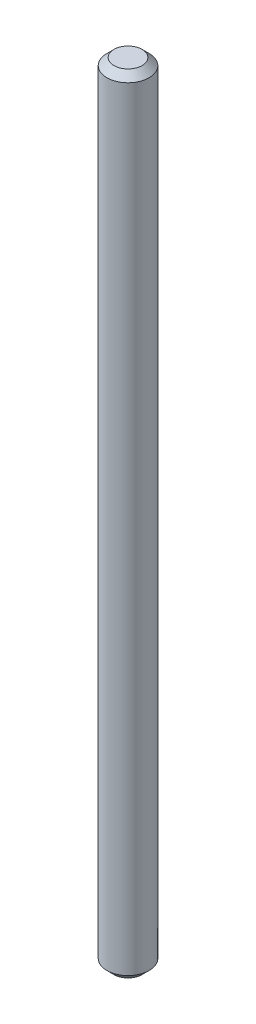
from build123d import *


with BuildPart() as part:
    # Sketch1 → Revolve1 (revolve)
    with BuildSketch(Plane.XY, mode=Mode.PRIVATE) as revolve1_sk:
        Polygon((1, 5), (1.5, 4.5), (1.5, -50.5), (1, -51), (0, -51), (0, 5), align=None)
    revolve(revolve1_sk.sketch.rotate(Axis((0, 5, 0), (0, 1, 0)), 90), axis=Axis((0, 5, 0), (0, 1, 0)))


solid = part.part
